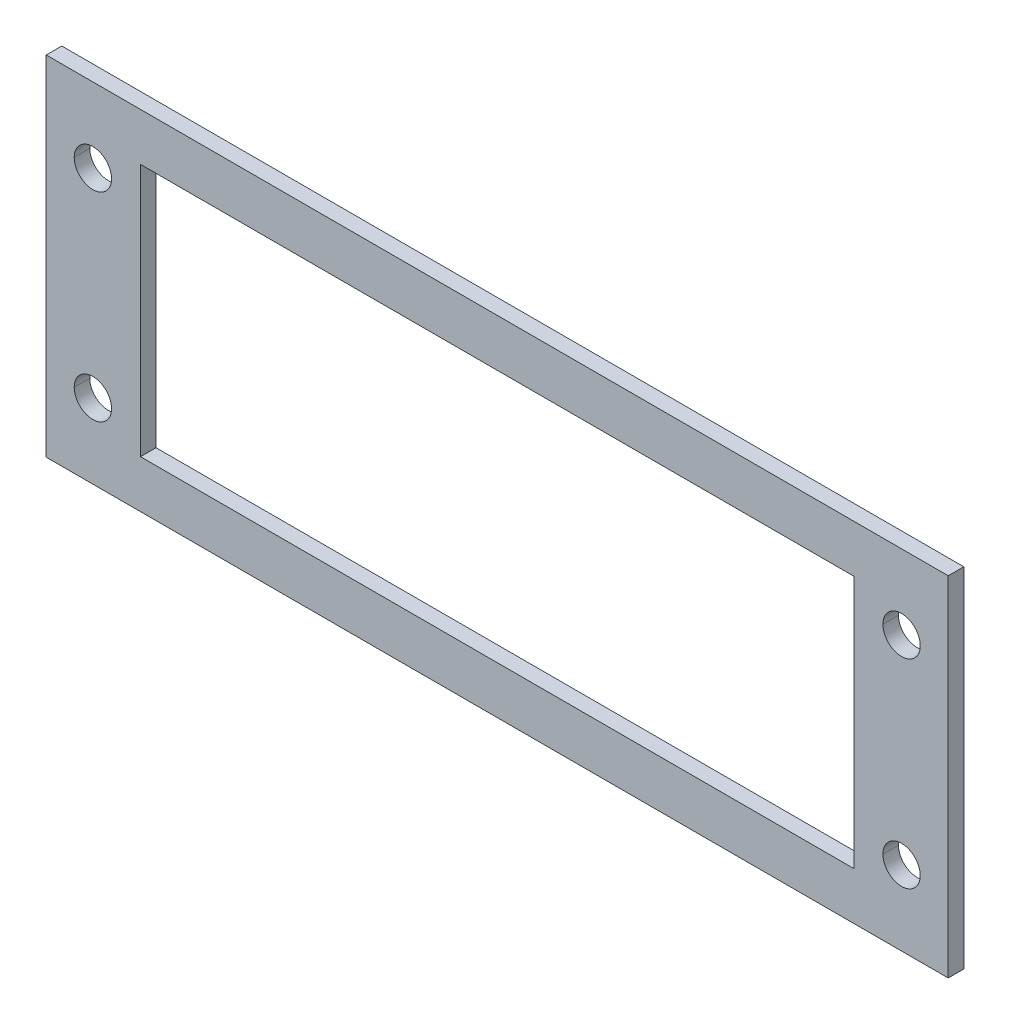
ISO-10303-21;
HEADER;
FILE_DESCRIPTION(('STEP AP214'),'2;1');
FILE_NAME('part.step','',(''),(''),'','','');
FILE_SCHEMA(('AUTOMOTIVE_DESIGN { 1 0 10303 214 1 1 1 1 }'));
ENDSEC;
DATA;
#1=APPLICATION_CONTEXT('core data for automotive mechanical design processes');
#2=APPLICATION_PROTOCOL_DEFINITION('international standard','automotive_design',2000,#1);
#3=PRODUCT_CONTEXT('',#1,'mechanical');
#4=PRODUCT('Part','Part','',(#3));
#5=PRODUCT_RELATED_PRODUCT_CATEGORY('part','',(#4));
#6=PRODUCT_DEFINITION_FORMATION('','',#4);
#7=PRODUCT_DEFINITION_CONTEXT('part definition',#1,'design');
#8=PRODUCT_DEFINITION('design','',#6,#7);
#9=PRODUCT_DEFINITION_SHAPE('','',#8);
#10=(LENGTH_UNIT() NAMED_UNIT(*) SI_UNIT(.MILLI.,.METRE.));
#11=(NAMED_UNIT(*) PLANE_ANGLE_UNIT() SI_UNIT($,.RADIAN.));
#12=(NAMED_UNIT(*) SI_UNIT($,.STERADIAN.) SOLID_ANGLE_UNIT());
#13=UNCERTAINTY_MEASURE_WITH_UNIT(LENGTH_MEASURE(1.E-05),#10,'distance_accuracy_value','');
#14=(GEOMETRIC_REPRESENTATION_CONTEXT(3) GLOBAL_UNCERTAINTY_ASSIGNED_CONTEXT((#13)) GLOBAL_UNIT_ASSIGNED_CONTEXT((#10,
#11,#12)) REPRESENTATION_CONTEXT('',''));
#15=CARTESIAN_POINT('',(0.,0.,0.));
#16=DIRECTION('',(0.,0.,1.));
#17=DIRECTION('',(1.,0.,0.));
#18=AXIS2_PLACEMENT_3D('',#15,#16,#17);
#19=CARTESIAN_POINT('',(65.,-16.,12.05));
#20=DIRECTION('',(0.,0.,1.));
#21=DIRECTION('',(1.,0.,0.));
#22=AXIS2_PLACEMENT_3D('',#19,#20,#21);
#23=CYLINDRICAL_SURFACE('',#22,3.);
#24=DIRECTION('',(0.,0.,1.));
#25=VECTOR('',#24,1.);
#26=CARTESIAN_POINT('',(62.,-16.,12.05));
#27=LINE('',#26,#25);
#28=CARTESIAN_POINT('',(62.,-16.,17.05));
#29=VERTEX_POINT('',#28);
#30=CARTESIAN_POINT('',(62.,-16.,19.55));
#31=VERTEX_POINT('',#30);
#32=EDGE_CURVE('E337',#29,#31,#27,.T.);
#33=ORIENTED_EDGE('',*,*,#32,.F.);
#34=CARTESIAN_POINT('',(65.,-16.,17.05));
#35=DIRECTION('',(0.,0.,-1.));
#36=DIRECTION('',(-1.,0.,0.));
#37=AXIS2_PLACEMENT_3D('',#34,#35,#36);
#38=CIRCLE('',#37,3.);
#39=CARTESIAN_POINT('',(68.,-16.,17.05));
#40=VERTEX_POINT('',#39);
#41=EDGE_CURVE('E229',#29,#40,#38,.T.);
#42=ORIENTED_EDGE('',*,*,#41,.T.);
#43=DIRECTION('',(0.,0.,1.));
#44=VECTOR('',#43,1.);
#45=CARTESIAN_POINT('',(68.,-16.,12.05));
#46=LINE('',#45,#44);
#47=CARTESIAN_POINT('',(68.,-16.,19.55));
#48=VERTEX_POINT('',#47);
#49=EDGE_CURVE('E352',#40,#48,#46,.T.);
#50=ORIENTED_EDGE('',*,*,#49,.T.);
#51=CARTESIAN_POINT('',(65.,-16.,19.55));
#52=DIRECTION('',(0.,0.,-1.));
#53=DIRECTION('',(-1.,0.,0.));
#54=AXIS2_PLACEMENT_3D('',#51,#52,#53);
#55=CIRCLE('',#54,3.);
#56=EDGE_CURVE('E300',#31,#48,#55,.T.);
#57=ORIENTED_EDGE('',*,*,#56,.F.);
#58=EDGE_LOOP('',(#33,#42,#50,#57));
#59=FACE_BOUND('',#58,.T.);
#60=ADVANCED_FACE('F15',(#59),#23,.F.);
#61=CARTESIAN_POINT('',(65.,16.,12.05));
#62=DIRECTION('',(0.,0.,1.));
#63=DIRECTION('',(1.,0.,0.));
#64=AXIS2_PLACEMENT_3D('',#61,#62,#63);
#65=CYLINDRICAL_SURFACE('',#64,3.);
#66=DIRECTION('',(0.,0.,1.));
#67=VECTOR('',#66,1.);
#68=CARTESIAN_POINT('',(62.,16.,12.05));
#69=LINE('',#68,#67);
#70=CARTESIAN_POINT('',(62.,16.,17.05));
#71=VERTEX_POINT('',#70);
#72=CARTESIAN_POINT('',(62.,16.,19.55));
#73=VERTEX_POINT('',#72);
#74=EDGE_CURVE('E370',#71,#73,#69,.T.);
#75=ORIENTED_EDGE('',*,*,#74,.F.);
#76=CARTESIAN_POINT('',(65.,16.,17.05));
#77=DIRECTION('',(0.,0.,-1.));
#78=DIRECTION('',(-1.,0.,0.));
#79=AXIS2_PLACEMENT_3D('',#76,#77,#78);
#80=CIRCLE('',#79,3.);
#81=CARTESIAN_POINT('',(68.,16.,17.05));
#82=VERTEX_POINT('',#81);
#83=EDGE_CURVE('E233',#71,#82,#80,.T.);
#84=ORIENTED_EDGE('',*,*,#83,.T.);
#85=DIRECTION('',(0.,0.,1.));
#86=VECTOR('',#85,1.);
#87=CARTESIAN_POINT('',(68.,16.,12.05));
#88=LINE('',#87,#86);
#89=CARTESIAN_POINT('',(68.,16.,19.55));
#90=VERTEX_POINT('',#89);
#91=EDGE_CURVE('E259',#82,#90,#88,.T.);
#92=ORIENTED_EDGE('',*,*,#91,.T.);
#93=CARTESIAN_POINT('',(65.,16.,19.55));
#94=DIRECTION('',(0.,0.,-1.));
#95=DIRECTION('',(-1.,0.,0.));
#96=AXIS2_PLACEMENT_3D('',#93,#94,#95);
#97=CIRCLE('',#96,3.);
#98=EDGE_CURVE('E303',#73,#90,#97,.T.);
#99=ORIENTED_EDGE('',*,*,#98,.F.);
#100=EDGE_LOOP('',(#75,#84,#92,#99));
#101=FACE_BOUND('',#100,.T.);
#102=ADVANCED_FACE('F329',(#101),#65,.F.);
#103=CARTESIAN_POINT('',(-65.,16.,12.05));
#104=DIRECTION('',(0.,0.,1.));
#105=DIRECTION('',(1.,0.,0.));
#106=AXIS2_PLACEMENT_3D('',#103,#104,#105);
#107=CYLINDRICAL_SURFACE('',#106,3.);
#108=DIRECTION('',(0.,0.,1.));
#109=VECTOR('',#108,1.);
#110=CARTESIAN_POINT('',(-68.,16.,12.05));
#111=LINE('',#110,#109);
#112=CARTESIAN_POINT('',(-68.,16.,17.05));
#113=VERTEX_POINT('',#112);
#114=CARTESIAN_POINT('',(-68.,16.,19.55));
#115=VERTEX_POINT('',#114);
#116=EDGE_CURVE('E245',#113,#115,#111,.T.);
#117=ORIENTED_EDGE('',*,*,#116,.F.);
#118=CARTESIAN_POINT('',(-65.,16.,17.05));
#119=DIRECTION('',(0.,0.,-1.));
#120=DIRECTION('',(-1.,0.,0.));
#121=AXIS2_PLACEMENT_3D('',#118,#119,#120);
#122=CIRCLE('',#121,3.);
#123=CARTESIAN_POINT('',(-62.,16.,17.05));
#124=VERTEX_POINT('',#123);
#125=EDGE_CURVE('E184',#113,#124,#122,.T.);
#126=ORIENTED_EDGE('',*,*,#125,.T.);
#127=DIRECTION('',(0.,0.,1.));
#128=VECTOR('',#127,1.);
#129=CARTESIAN_POINT('',(-62.,16.,12.05));
#130=LINE('',#129,#128);
#131=CARTESIAN_POINT('',(-62.,16.,19.55));
#132=VERTEX_POINT('',#131);
#133=EDGE_CURVE('E242',#124,#132,#130,.T.);
#134=ORIENTED_EDGE('',*,*,#133,.T.);
#135=CARTESIAN_POINT('',(-65.,16.,19.55));
#136=DIRECTION('',(0.,0.,-1.));
#137=DIRECTION('',(-1.,0.,0.));
#138=AXIS2_PLACEMENT_3D('',#135,#136,#137);
#139=CIRCLE('',#138,3.);
#140=EDGE_CURVE('E306',#115,#132,#139,.T.);
#141=ORIENTED_EDGE('',*,*,#140,.F.);
#142=EDGE_LOOP('',(#117,#126,#134,#141));
#143=FACE_BOUND('',#142,.T.);
#144=ADVANCED_FACE('F241',(#143),#107,.F.);
#145=CARTESIAN_POINT('',(-65.,-16.,12.05));
#146=DIRECTION('',(0.,0.,1.));
#147=DIRECTION('',(1.,0.,0.));
#148=AXIS2_PLACEMENT_3D('',#145,#146,#147);
#149=CYLINDRICAL_SURFACE('',#148,3.);
#150=DIRECTION('',(0.,0.,1.));
#151=VECTOR('',#150,1.);
#152=CARTESIAN_POINT('',(-68.,-16.,12.05));
#153=LINE('',#152,#151);
#154=CARTESIAN_POINT('',(-68.,-16.,17.05));
#155=VERTEX_POINT('',#154);
#156=CARTESIAN_POINT('',(-68.,-16.,19.55));
#157=VERTEX_POINT('',#156);
#158=EDGE_CURVE('E278',#155,#157,#153,.T.);
#159=ORIENTED_EDGE('',*,*,#158,.F.);
#160=CARTESIAN_POINT('',(-65.,-16.,17.05));
#161=DIRECTION('',(0.,0.,-1.));
#162=DIRECTION('',(-1.,0.,0.));
#163=AXIS2_PLACEMENT_3D('',#160,#161,#162);
#164=CIRCLE('',#163,3.);
#165=CARTESIAN_POINT('',(-62.,-16.,17.05));
#166=VERTEX_POINT('',#165);
#167=EDGE_CURVE('E178',#155,#166,#164,.T.);
#168=ORIENTED_EDGE('',*,*,#167,.T.);
#169=DIRECTION('',(0.,0.,1.));
#170=VECTOR('',#169,1.);
#171=CARTESIAN_POINT('',(-62.,-16.,12.05));
#172=LINE('',#171,#170);
#173=CARTESIAN_POINT('',(-62.,-16.,19.55));
#174=VERTEX_POINT('',#173);
#175=EDGE_CURVE('E279',#166,#174,#172,.T.);
#176=ORIENTED_EDGE('',*,*,#175,.T.);
#177=CARTESIAN_POINT('',(-65.,-16.,19.55));
#178=DIRECTION('',(0.,0.,-1.));
#179=DIRECTION('',(-1.,0.,0.));
#180=AXIS2_PLACEMENT_3D('',#177,#178,#179);
#181=CIRCLE('',#180,3.);
#182=EDGE_CURVE('E309',#157,#174,#181,.T.);
#183=ORIENTED_EDGE('',*,*,#182,.F.);
#184=EDGE_LOOP('',(#159,#168,#176,#183));
#185=FACE_BOUND('',#184,.T.);
#186=ADVANCED_FACE('F316',(#185),#149,.F.);
#187=CARTESIAN_POINT('',(57.35,-20.35,12.05));
#188=DIRECTION('',(1.,0.,0.));
#189=DIRECTION('',(0.,1.,0.));
#190=AXIS2_PLACEMENT_3D('',#187,#188,#189);
#191=PLANE('',#190);
#192=DIRECTION('',(0.,0.,1.));
#193=VECTOR('',#192,1.);
#194=CARTESIAN_POINT('',(57.35,20.35,12.05));
#195=LINE('',#194,#193);
#196=CARTESIAN_POINT('',(57.35,20.35,17.05));
#197=VERTEX_POINT('',#196);
#198=CARTESIAN_POINT('',(57.35,20.35,19.55));
#199=VERTEX_POINT('',#198);
#200=EDGE_CURVE('E10',#197,#199,#195,.T.);
#201=ORIENTED_EDGE('',*,*,#200,.F.);
#202=DIRECTION('',(0.,-1.,0.));
#203=VECTOR('',#202,1.);
#204=CARTESIAN_POINT('',(57.35,0.,17.05));
#205=LINE('',#204,#203);
#206=CARTESIAN_POINT('',(57.35,-20.35,17.05));
#207=VERTEX_POINT('',#206);
#208=EDGE_CURVE('E177',#197,#207,#205,.T.);
#209=ORIENTED_EDGE('',*,*,#208,.T.);
#210=DIRECTION('',(0.,0.,1.));
#211=VECTOR('',#210,1.);
#212=CARTESIAN_POINT('',(57.35,-20.35,12.05));
#213=LINE('',#212,#211);
#214=CARTESIAN_POINT('',(57.35,-20.35,19.55));
#215=VERTEX_POINT('',#214);
#216=EDGE_CURVE('E162',#207,#215,#213,.T.);
#217=ORIENTED_EDGE('',*,*,#216,.T.);
#218=DIRECTION('',(0.,-1.,0.));
#219=VECTOR('',#218,1.);
#220=CARTESIAN_POINT('',(57.35,0.,19.55));
#221=LINE('',#220,#219);
#222=EDGE_CURVE('E213',#199,#215,#221,.T.);
#223=ORIENTED_EDGE('',*,*,#222,.F.);
#224=EDGE_LOOP('',(#201,#209,#217,#223));
#225=FACE_BOUND('',#224,.T.);
#226=ADVANCED_FACE('F314',(#225),#191,.F.);
#227=CARTESIAN_POINT('',(57.35,20.35,12.05));
#228=DIRECTION('',(0.,1.,0.));
#229=DIRECTION('',(1.,0.,0.));
#230=AXIS2_PLACEMENT_3D('',#227,#228,#229);
#231=PLANE('',#230);
#232=DIRECTION('',(0.,0.,1.));
#233=VECTOR('',#232,1.);
#234=CARTESIAN_POINT('',(-57.35,20.35,12.05));
#235=LINE('',#234,#233);
#236=CARTESIAN_POINT('',(-57.35,20.35,17.05));
#237=VERTEX_POINT('',#236);
#238=CARTESIAN_POINT('',(-57.35,20.35,19.55));
#239=VERTEX_POINT('',#238);
#240=EDGE_CURVE('E24',#237,#239,#235,.T.);
#241=ORIENTED_EDGE('',*,*,#240,.F.);
#242=DIRECTION('',(1.,0.,0.));
#243=VECTOR('',#242,1.);
#244=CARTESIAN_POINT('',(0.,20.35,17.05));
#245=LINE('',#244,#243);
#246=EDGE_CURVE('E170',#237,#197,#245,.T.);
#247=ORIENTED_EDGE('',*,*,#246,.T.);
#248=ORIENTED_EDGE('',*,*,#200,.T.);
#249=DIRECTION('',(1.,0.,0.));
#250=VECTOR('',#249,1.);
#251=CARTESIAN_POINT('',(0.,20.35,19.55));
#252=LINE('',#251,#250);
#253=EDGE_CURVE('E198',#239,#199,#252,.T.);
#254=ORIENTED_EDGE('',*,*,#253,.F.);
#255=EDGE_LOOP('',(#241,#247,#248,#254));
#256=FACE_BOUND('',#255,.T.);
#257=ADVANCED_FACE('F199',(#256),#231,.F.);
#258=CARTESIAN_POINT('',(-57.35,20.35,12.05));
#259=DIRECTION('',(-1.,0.,0.));
#260=DIRECTION('',(0.,0.,1.));
#261=AXIS2_PLACEMENT_3D('',#258,#259,#260);
#262=PLANE('',#261);
#263=DIRECTION('',(0.,0.,1.));
#264=VECTOR('',#263,1.);
#265=CARTESIAN_POINT('',(-57.35,-20.35,12.05));
#266=LINE('',#265,#264);
#267=CARTESIAN_POINT('',(-57.35,-20.35,17.05));
#268=VERTEX_POINT('',#267);
#269=CARTESIAN_POINT('',(-57.35,-20.35,19.55));
#270=VERTEX_POINT('',#269);
#271=EDGE_CURVE('E150',#268,#270,#266,.T.);
#272=ORIENTED_EDGE('',*,*,#271,.F.);
#273=DIRECTION('',(0.,1.,0.));
#274=VECTOR('',#273,1.);
#275=CARTESIAN_POINT('',(-57.35,0.,17.05));
#276=LINE('',#275,#274);
#277=EDGE_CURVE('E153',#268,#237,#276,.T.);
#278=ORIENTED_EDGE('',*,*,#277,.T.);
#279=ORIENTED_EDGE('',*,*,#240,.T.);
#280=DIRECTION('',(0.,1.,0.));
#281=VECTOR('',#280,1.);
#282=CARTESIAN_POINT('',(-57.35,0.,19.55));
#283=LINE('',#282,#281);
#284=EDGE_CURVE('E156',#270,#239,#283,.T.);
#285=ORIENTED_EDGE('',*,*,#284,.F.);
#286=EDGE_LOOP('',(#272,#278,#279,#285));
#287=FACE_BOUND('',#286,.T.);
#288=ADVANCED_FACE('F152',(#287),#262,.F.);
#289=CARTESIAN_POINT('',(-57.35,-20.35,12.05));
#290=DIRECTION('',(0.,-1.,0.));
#291=DIRECTION('',(0.,0.,-1.));
#292=AXIS2_PLACEMENT_3D('',#289,#290,#291);
#293=PLANE('',#292);
#294=ORIENTED_EDGE('',*,*,#216,.F.);
#295=DIRECTION('',(-1.,0.,0.));
#296=VECTOR('',#295,1.);
#297=CARTESIAN_POINT('',(0.,-20.35,17.05));
#298=LINE('',#297,#296);
#299=EDGE_CURVE('E169',#207,#268,#298,.T.);
#300=ORIENTED_EDGE('',*,*,#299,.T.);
#301=ORIENTED_EDGE('',*,*,#271,.T.);
#302=DIRECTION('',(-1.,0.,0.));
#303=VECTOR('',#302,1.);
#304=CARTESIAN_POINT('',(0.,-20.35,19.55));
#305=LINE('',#304,#303);
#306=EDGE_CURVE('E208',#215,#270,#305,.T.);
#307=ORIENTED_EDGE('',*,*,#306,.F.);
#308=EDGE_LOOP('',(#294,#300,#301,#307));
#309=FACE_BOUND('',#308,.T.);
#310=ADVANCED_FACE('F174',(#309),#293,.F.);
#311=CARTESIAN_POINT('',(-72.5,-28.,19.55));
#312=DIRECTION('',(0.,1.,0.));
#313=DIRECTION('',(1.,0.,0.));
#314=AXIS2_PLACEMENT_3D('',#311,#312,#313);
#315=PLANE('',#314);
#316=DIRECTION('',(1.,0.,0.));
#317=VECTOR('',#316,1.);
#318=CARTESIAN_POINT('',(-72.5,-28.,17.05));
#319=LINE('',#318,#317);
#320=CARTESIAN_POINT('',(-72.5,-28.,17.05));
#321=VERTEX_POINT('',#320);
#322=CARTESIAN_POINT('',(72.5,-28.,17.05));
#323=VERTEX_POINT('',#322);
#324=EDGE_CURVE('E220',#321,#323,#319,.T.);
#325=ORIENTED_EDGE('',*,*,#324,.T.);
#326=DIRECTION('',(0.,0.,-1.));
#327=VECTOR('',#326,1.);
#328=CARTESIAN_POINT('',(72.5,-28.,19.55));
#329=LINE('',#328,#327);
#330=CARTESIAN_POINT('',(72.5,-28.,19.55));
#331=VERTEX_POINT('',#330);
#332=EDGE_CURVE('E192',#331,#323,#329,.T.);
#333=ORIENTED_EDGE('',*,*,#332,.F.);
#334=DIRECTION('',(1.,0.,0.));
#335=VECTOR('',#334,1.);
#336=CARTESIAN_POINT('',(-72.5,-28.,19.55));
#337=LINE('',#336,#335);
#338=CARTESIAN_POINT('',(-72.5,-28.,19.55));
#339=VERTEX_POINT('',#338);
#340=EDGE_CURVE('E296',#339,#331,#337,.T.);
#341=ORIENTED_EDGE('',*,*,#340,.F.);
#342=DIRECTION('',(0.,0.,-1.));
#343=VECTOR('',#342,1.);
#344=CARTESIAN_POINT('',(-72.5,-28.,19.55));
#345=LINE('',#344,#343);
#346=EDGE_CURVE('E194',#339,#321,#345,.T.);
#347=ORIENTED_EDGE('',*,*,#346,.T.);
#348=EDGE_LOOP('',(#325,#333,#341,#347));
#349=FACE_BOUND('',#348,.T.);
#350=ADVANCED_FACE('F410',(#349),#315,.F.);
#351=CARTESIAN_POINT('',(-72.5,-28.,19.55));
#352=DIRECTION('',(1.,0.,0.));
#353=DIRECTION('',(0.,1.,0.));
#354=AXIS2_PLACEMENT_3D('',#351,#352,#353);
#355=PLANE('',#354);
#356=DIRECTION('',(0.,-1.,0.));
#357=VECTOR('',#356,1.);
#358=CARTESIAN_POINT('',(-72.5,-28.,17.05));
#359=LINE('',#358,#357);
#360=CARTESIAN_POINT('',(-72.5,28.,17.05));
#361=VERTEX_POINT('',#360);
#362=EDGE_CURVE('E221',#361,#321,#359,.T.);
#363=ORIENTED_EDGE('',*,*,#362,.T.);
#364=ORIENTED_EDGE('',*,*,#346,.F.);
#365=DIRECTION('',(0.,-1.,0.));
#366=VECTOR('',#365,1.);
#367=CARTESIAN_POINT('',(-72.5,-28.,19.55));
#368=LINE('',#367,#366);
#369=CARTESIAN_POINT('',(-72.5,28.,19.55));
#370=VERTEX_POINT('',#369);
#371=EDGE_CURVE('E292',#370,#339,#368,.T.);
#372=ORIENTED_EDGE('',*,*,#371,.F.);
#373=DIRECTION('',(0.,0.,-1.));
#374=VECTOR('',#373,1.);
#375=CARTESIAN_POINT('',(-72.5,28.,19.55));
#376=LINE('',#375,#374);
#377=EDGE_CURVE('E271',#370,#361,#376,.T.);
#378=ORIENTED_EDGE('',*,*,#377,.T.);
#379=EDGE_LOOP('',(#363,#364,#372,#378));
#380=FACE_BOUND('',#379,.T.);
#381=ADVANCED_FACE('F404',(#380),#355,.F.);
#382=CARTESIAN_POINT('',(-72.5,28.,19.55));
#383=DIRECTION('',(0.,-1.,0.));
#384=DIRECTION('',(0.,0.,-1.));
#385=AXIS2_PLACEMENT_3D('',#382,#383,#384);
#386=PLANE('',#385);
#387=DIRECTION('',(-1.,0.,0.));
#388=VECTOR('',#387,1.);
#389=CARTESIAN_POINT('',(-72.5,28.,17.05));
#390=LINE('',#389,#388);
#391=CARTESIAN_POINT('',(72.5,28.,17.05));
#392=VERTEX_POINT('',#391);
#393=EDGE_CURVE('E225',#392,#361,#390,.T.);
#394=ORIENTED_EDGE('',*,*,#393,.T.);
#395=ORIENTED_EDGE('',*,*,#377,.F.);
#396=DIRECTION('',(-1.,0.,0.));
#397=VECTOR('',#396,1.);
#398=CARTESIAN_POINT('',(-72.5,28.,19.55));
#399=LINE('',#398,#397);
#400=CARTESIAN_POINT('',(72.5,28.,19.55));
#401=VERTEX_POINT('',#400);
#402=EDGE_CURVE('E288',#401,#370,#399,.T.);
#403=ORIENTED_EDGE('',*,*,#402,.F.);
#404=DIRECTION('',(0.,0.,-1.));
#405=VECTOR('',#404,1.);
#406=CARTESIAN_POINT('',(72.5,28.,19.55));
#407=LINE('',#406,#405);
#408=EDGE_CURVE('E172',#401,#392,#407,.T.);
#409=ORIENTED_EDGE('',*,*,#408,.T.);
#410=EDGE_LOOP('',(#394,#395,#403,#409));
#411=FACE_BOUND('',#410,.T.);
#412=ADVANCED_FACE('F400',(#411),#386,.F.);
#413=CARTESIAN_POINT('',(72.5,-28.,19.55));
#414=DIRECTION('',(-1.,0.,0.));
#415=DIRECTION('',(0.,0.,1.));
#416=AXIS2_PLACEMENT_3D('',#413,#414,#415);
#417=PLANE('',#416);
#418=DIRECTION('',(0.,1.,0.));
#419=VECTOR('',#418,1.);
#420=CARTESIAN_POINT('',(72.5,-28.,17.05));
#421=LINE('',#420,#419);
#422=EDGE_CURVE('E204',#323,#392,#421,.T.);
#423=ORIENTED_EDGE('',*,*,#422,.T.);
#424=ORIENTED_EDGE('',*,*,#408,.F.);
#425=DIRECTION('',(0.,1.,0.));
#426=VECTOR('',#425,1.);
#427=CARTESIAN_POINT('',(72.5,-28.,19.55));
#428=LINE('',#427,#426);
#429=EDGE_CURVE('E283',#331,#401,#428,.T.);
#430=ORIENTED_EDGE('',*,*,#429,.F.);
#431=ORIENTED_EDGE('',*,*,#332,.T.);
#432=EDGE_LOOP('',(#423,#424,#430,#431));
#433=FACE_BOUND('',#432,.T.);
#434=ADVANCED_FACE('F393',(#433),#417,.F.);
#435=CARTESIAN_POINT('',(0.,0.,17.05));
#436=DIRECTION('',(0.,0.,-1.));
#437=DIRECTION('',(0.,-1.,0.));
#438=AXIS2_PLACEMENT_3D('',#435,#436,#437);
#439=PLANE('',#438);
#440=ORIENTED_EDGE('',*,*,#299,.F.);
#441=ORIENTED_EDGE('',*,*,#208,.F.);
#442=ORIENTED_EDGE('',*,*,#246,.F.);
#443=ORIENTED_EDGE('',*,*,#277,.F.);
#444=EDGE_LOOP('',(#440,#441,#442,#443));
#445=FACE_BOUND('',#444,.T.);
#446=CARTESIAN_POINT('',(-65.,-16.,17.05));
#447=DIRECTION('',(0.,0.,-1.));
#448=DIRECTION('',(-1.,0.,0.));
#449=AXIS2_PLACEMENT_3D('',#446,#447,#448);
#450=CIRCLE('',#449,3.);
#451=EDGE_CURVE('E255',#166,#155,#450,.T.);
#452=ORIENTED_EDGE('',*,*,#451,.F.);
#453=ORIENTED_EDGE('',*,*,#167,.F.);
#454=EDGE_LOOP('',(#452,#453));
#455=FACE_BOUND('',#454,.T.);
#456=CARTESIAN_POINT('',(-65.,16.,17.05));
#457=DIRECTION('',(0.,0.,-1.));
#458=DIRECTION('',(-1.,0.,0.));
#459=AXIS2_PLACEMENT_3D('',#456,#457,#458);
#460=CIRCLE('',#459,3.);
#461=EDGE_CURVE('E251',#124,#113,#460,.T.);
#462=ORIENTED_EDGE('',*,*,#461,.F.);
#463=ORIENTED_EDGE('',*,*,#125,.F.);
#464=EDGE_LOOP('',(#462,#463));
#465=FACE_BOUND('',#464,.T.);
#466=CARTESIAN_POINT('',(65.,16.,17.05));
#467=DIRECTION('',(0.,0.,-1.));
#468=DIRECTION('',(-1.,0.,0.));
#469=AXIS2_PLACEMENT_3D('',#466,#467,#468);
#470=CIRCLE('',#469,3.);
#471=EDGE_CURVE('E366',#82,#71,#470,.T.);
#472=ORIENTED_EDGE('',*,*,#471,.F.);
#473=ORIENTED_EDGE('',*,*,#83,.F.);
#474=EDGE_LOOP('',(#472,#473));
#475=FACE_BOUND('',#474,.T.);
#476=CARTESIAN_POINT('',(65.,-16.,17.05));
#477=DIRECTION('',(0.,0.,-1.));
#478=DIRECTION('',(-1.,0.,0.));
#479=AXIS2_PLACEMENT_3D('',#476,#477,#478);
#480=CIRCLE('',#479,3.);
#481=EDGE_CURVE('E348',#40,#29,#480,.T.);
#482=ORIENTED_EDGE('',*,*,#481,.F.);
#483=ORIENTED_EDGE('',*,*,#41,.F.);
#484=EDGE_LOOP('',(#482,#483));
#485=FACE_BOUND('',#484,.T.);
#486=ORIENTED_EDGE('',*,*,#422,.F.);
#487=ORIENTED_EDGE('',*,*,#324,.F.);
#488=ORIENTED_EDGE('',*,*,#362,.F.);
#489=ORIENTED_EDGE('',*,*,#393,.F.);
#490=EDGE_LOOP('',(#486,#487,#488,#489));
#491=FACE_BOUND('',#490,.T.);
#492=ADVANCED_FACE('F166',(#445,#455,#465,#475,#485,#491),#439,.T.);
#493=CARTESIAN_POINT('',(0.,0.,19.55));
#494=DIRECTION('',(0.,0.,-1.));
#495=DIRECTION('',(0.,-1.,0.));
#496=AXIS2_PLACEMENT_3D('',#493,#494,#495);
#497=PLANE('',#496);
#498=ORIENTED_EDGE('',*,*,#222,.T.);
#499=ORIENTED_EDGE('',*,*,#306,.T.);
#500=ORIENTED_EDGE('',*,*,#284,.T.);
#501=ORIENTED_EDGE('',*,*,#253,.T.);
#502=EDGE_LOOP('',(#498,#499,#500,#501));
#503=FACE_BOUND('',#502,.T.);
#504=CARTESIAN_POINT('',(-65.,-16.,19.55));
#505=DIRECTION('',(0.,0.,-1.));
#506=DIRECTION('',(-1.,0.,0.));
#507=AXIS2_PLACEMENT_3D('',#504,#505,#506);
#508=CIRCLE('',#507,3.);
#509=EDGE_CURVE('E284',#174,#157,#508,.T.);
#510=ORIENTED_EDGE('',*,*,#509,.T.);
#511=ORIENTED_EDGE('',*,*,#182,.T.);
#512=EDGE_LOOP('',(#510,#511));
#513=FACE_BOUND('',#512,.T.);
#514=CARTESIAN_POINT('',(-65.,16.,19.55));
#515=DIRECTION('',(0.,0.,-1.));
#516=DIRECTION('',(-1.,0.,0.));
#517=AXIS2_PLACEMENT_3D('',#514,#515,#516);
#518=CIRCLE('',#517,3.);
#519=EDGE_CURVE('E253',#132,#115,#518,.T.);
#520=ORIENTED_EDGE('',*,*,#519,.T.);
#521=ORIENTED_EDGE('',*,*,#140,.T.);
#522=EDGE_LOOP('',(#520,#521));
#523=FACE_BOUND('',#522,.T.);
#524=CARTESIAN_POINT('',(65.,16.,19.55));
#525=DIRECTION('',(0.,0.,-1.));
#526=DIRECTION('',(-1.,0.,0.));
#527=AXIS2_PLACEMENT_3D('',#524,#525,#526);
#528=CIRCLE('',#527,3.);
#529=EDGE_CURVE('E267',#90,#73,#528,.T.);
#530=ORIENTED_EDGE('',*,*,#529,.T.);
#531=ORIENTED_EDGE('',*,*,#98,.T.);
#532=EDGE_LOOP('',(#530,#531));
#533=FACE_BOUND('',#532,.T.);
#534=CARTESIAN_POINT('',(65.,-16.,19.55));
#535=DIRECTION('',(0.,0.,-1.));
#536=DIRECTION('',(-1.,0.,0.));
#537=AXIS2_PLACEMENT_3D('',#534,#535,#536);
#538=CIRCLE('',#537,3.);
#539=EDGE_CURVE('E347',#48,#31,#538,.T.);
#540=ORIENTED_EDGE('',*,*,#539,.T.);
#541=ORIENTED_EDGE('',*,*,#56,.T.);
#542=EDGE_LOOP('',(#540,#541));
#543=FACE_BOUND('',#542,.T.);
#544=ORIENTED_EDGE('',*,*,#429,.T.);
#545=ORIENTED_EDGE('',*,*,#402,.T.);
#546=ORIENTED_EDGE('',*,*,#371,.T.);
#547=ORIENTED_EDGE('',*,*,#340,.T.);
#548=EDGE_LOOP('',(#544,#545,#546,#547));
#549=FACE_BOUND('',#548,.T.);
#550=ADVANCED_FACE('F206',(#503,#513,#523,#533,#543,#549),#497,.F.);
#551=CARTESIAN_POINT('',(-65.,-16.,12.05));
#552=DIRECTION('',(0.,0.,1.));
#553=DIRECTION('',(1.,0.,0.));
#554=AXIS2_PLACEMENT_3D('',#551,#552,#553);
#555=CYLINDRICAL_SURFACE('',#554,3.);
#556=ORIENTED_EDGE('',*,*,#451,.T.);
#557=ORIENTED_EDGE('',*,*,#158,.T.);
#558=ORIENTED_EDGE('',*,*,#509,.F.);
#559=ORIENTED_EDGE('',*,*,#175,.F.);
#560=EDGE_LOOP('',(#556,#557,#558,#559));
#561=FACE_BOUND('',#560,.T.);
#562=ADVANCED_FACE('F390',(#561),#555,.F.);
#563=CARTESIAN_POINT('',(-65.,16.,12.05));
#564=DIRECTION('',(0.,0.,1.));
#565=DIRECTION('',(1.,0.,0.));
#566=AXIS2_PLACEMENT_3D('',#563,#564,#565);
#567=CYLINDRICAL_SURFACE('',#566,3.);
#568=ORIENTED_EDGE('',*,*,#461,.T.);
#569=ORIENTED_EDGE('',*,*,#116,.T.);
#570=ORIENTED_EDGE('',*,*,#519,.F.);
#571=ORIENTED_EDGE('',*,*,#133,.F.);
#572=EDGE_LOOP('',(#568,#569,#570,#571));
#573=FACE_BOUND('',#572,.T.);
#574=ADVANCED_FACE('F250',(#573),#567,.F.);
#575=CARTESIAN_POINT('',(65.,16.,12.05));
#576=DIRECTION('',(0.,0.,1.));
#577=DIRECTION('',(1.,0.,0.));
#578=AXIS2_PLACEMENT_3D('',#575,#576,#577);
#579=CYLINDRICAL_SURFACE('',#578,3.);
#580=ORIENTED_EDGE('',*,*,#471,.T.);
#581=ORIENTED_EDGE('',*,*,#74,.T.);
#582=ORIENTED_EDGE('',*,*,#529,.F.);
#583=ORIENTED_EDGE('',*,*,#91,.F.);
#584=EDGE_LOOP('',(#580,#581,#582,#583));
#585=FACE_BOUND('',#584,.T.);
#586=ADVANCED_FACE('F418',(#585),#579,.F.);
#587=CARTESIAN_POINT('',(65.,-16.,12.05));
#588=DIRECTION('',(0.,0.,1.));
#589=DIRECTION('',(1.,0.,0.));
#590=AXIS2_PLACEMENT_3D('',#587,#588,#589);
#591=CYLINDRICAL_SURFACE('',#590,3.);
#592=ORIENTED_EDGE('',*,*,#481,.T.);
#593=ORIENTED_EDGE('',*,*,#32,.T.);
#594=ORIENTED_EDGE('',*,*,#539,.F.);
#595=ORIENTED_EDGE('',*,*,#49,.F.);
#596=EDGE_LOOP('',(#592,#593,#594,#595));
#597=FACE_BOUND('',#596,.T.);
#598=ADVANCED_FACE('F351',(#597),#591,.F.);
#599=CLOSED_SHELL('',(#60,#102,#144,#186,#226,#257,#288,#310,#350,#381,#412,#434,#492,#550,#562,
#574,#586,#598));
#600=MANIFOLD_SOLID_BREP('B1',#599);
#601=ADVANCED_BREP_SHAPE_REPRESENTATION('',(#18,#600),#14);
#602=SHAPE_DEFINITION_REPRESENTATION(#9,#601);
ENDSEC;
END-ISO-10303-21;
